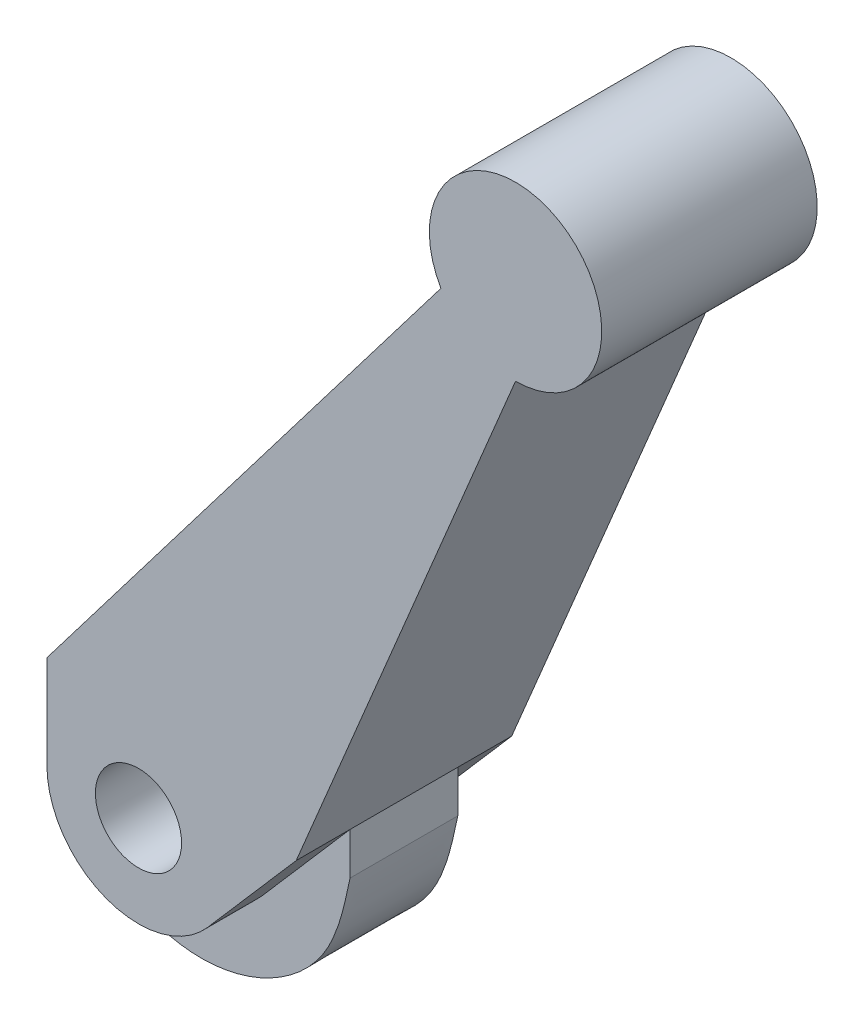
ISO-10303-21;
HEADER;
FILE_DESCRIPTION(('STEP AP214'),'2;1');
FILE_NAME('part.step','',(''),(''),'','','');
FILE_SCHEMA(('AUTOMOTIVE_DESIGN { 1 0 10303 214 1 1 1 1 }'));
ENDSEC;
DATA;
#1=APPLICATION_CONTEXT('core data for automotive mechanical design processes');
#2=APPLICATION_PROTOCOL_DEFINITION('international standard','automotive_design',2000,#1);
#3=PRODUCT_CONTEXT('',#1,'mechanical');
#4=PRODUCT('Part','Part','',(#3));
#5=PRODUCT_RELATED_PRODUCT_CATEGORY('part','',(#4));
#6=PRODUCT_DEFINITION_FORMATION('','',#4);
#7=PRODUCT_DEFINITION_CONTEXT('part definition',#1,'design');
#8=PRODUCT_DEFINITION('design','',#6,#7);
#9=PRODUCT_DEFINITION_SHAPE('','',#8);
#10=(LENGTH_UNIT() NAMED_UNIT(*) SI_UNIT(.MILLI.,.METRE.));
#11=(NAMED_UNIT(*) PLANE_ANGLE_UNIT() SI_UNIT($,.RADIAN.));
#12=(NAMED_UNIT(*) SI_UNIT($,.STERADIAN.) SOLID_ANGLE_UNIT());
#13=UNCERTAINTY_MEASURE_WITH_UNIT(LENGTH_MEASURE(1.E-05),#10,'distance_accuracy_value','');
#14=(GEOMETRIC_REPRESENTATION_CONTEXT(3) GLOBAL_UNCERTAINTY_ASSIGNED_CONTEXT((#13)) GLOBAL_UNIT_ASSIGNED_CONTEXT((#10,
#11,#12)) REPRESENTATION_CONTEXT('',''));
#15=CARTESIAN_POINT('',(0.,0.,0.));
#16=DIRECTION('',(0.,0.,1.));
#17=DIRECTION('',(1.,0.,0.));
#18=AXIS2_PLACEMENT_3D('',#15,#16,#17);
#19=CARTESIAN_POINT('',(0.513884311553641,-6.67200795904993,-2.5));
#20=DIRECTION('',(0.,0.,-1.));
#21=DIRECTION('',(-1.,0.,0.));
#22=AXIS2_PLACEMENT_3D('',#19,#20,#21);
#23=PLANE('',#22);
#24=DIRECTION('',(-0.606222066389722,-0.795295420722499,0.));
#25=VECTOR('',#24,1.);
#26=CARTESIAN_POINT('',(-4.77177252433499,3.63733239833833,-2.5));
#27=LINE('',#26,#25);
#28=CARTESIAN_POINT('',(-4.25,4.32183948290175,-2.5));
#29=VERTEX_POINT('',#28);
#30=CARTESIAN_POINT('',(-4.77177252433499,3.63733239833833,-2.5));
#31=VERTEX_POINT('',#30);
#32=EDGE_CURVE('E194',#29,#31,#27,.T.);
#33=ORIENTED_EDGE('',*,*,#32,.F.);
#34=DIRECTION('',(0.,-1.,0.));
#35=VECTOR('',#34,1.);
#36=CARTESIAN_POINT('',(-4.25,4.32183948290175,-2.5));
#37=LINE('',#36,#35);
#38=CARTESIAN_POINT('',(-4.25,0.,-2.5));
#39=VERTEX_POINT('',#38);
#40=EDGE_CURVE('E134',#29,#39,#37,.T.);
#41=ORIENTED_EDGE('',*,*,#40,.T.);
#42=CARTESIAN_POINT('',(0.,0.,-2.5));
#43=DIRECTION('',(0.,0.,1.));
#44=DIRECTION('',(1.,0.,0.));
#45=AXIS2_PLACEMENT_3D('',#42,#43,#44);
#46=CIRCLE('',#45,4.25);
#47=CARTESIAN_POINT('',(3.21104015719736,-2.78419128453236,-2.5));
#48=VERTEX_POINT('',#47);
#49=EDGE_CURVE('E115',#39,#48,#46,.T.);
#50=ORIENTED_EDGE('',*,*,#49,.T.);
#51=DIRECTION('',(0.655103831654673,0.755538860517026,0.));
#52=VECTOR('',#51,1.);
#53=CARTESIAN_POINT('',(3.21104015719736,-2.78419128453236,-2.5));
#54=LINE('',#53,#52);
#55=CARTESIAN_POINT('',(7.32,1.95471984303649,-2.5));
#56=VERTEX_POINT('',#55);
#57=EDGE_CURVE('E126',#48,#56,#54,.T.);
#58=ORIENTED_EDGE('',*,*,#57,.T.);
#59=DIRECTION('',(0.,1.,0.));
#60=VECTOR('',#59,1.);
#61=CARTESIAN_POINT('',(7.32,0.,-2.5));
#62=LINE('',#61,#60);
#63=CARTESIAN_POINT('',(7.32,0.,-2.5));
#64=VERTEX_POINT('',#63);
#65=EDGE_CURVE('E189',#64,#56,#62,.T.);
#66=ORIENTED_EDGE('',*,*,#65,.F.);
#67=CARTESIAN_POINT('',(-6.,0.,-2.5));
#68=CARTESIAN_POINT('',(-5.90543584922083,-1.07687700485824,-2.5));
#69=CARTESIAN_POINT('',(-5.71291765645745,-3.26923439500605,-2.5));
#70=CARTESIAN_POINT('',(-3.33365590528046,-5.85250984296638,-2.5));
#71=CARTESIAN_POINT('',(0.0190576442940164,-6.9748234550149,-2.5));
#72=CARTESIAN_POINT('',(3.59953729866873,-6.22879858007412,-2.5));
#73=CARTESIAN_POINT('',(6.53497983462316,-3.70497981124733,-2.5));
#74=CARTESIAN_POINT('',(7.05564668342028,-1.24764145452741,-2.5));
#75=CARTESIAN_POINT('',(7.32,0.,-2.5));
#76=B_SPLINE_CURVE_WITH_KNOTS('',3,(#67,#68,#69,#70,#71,#72,#73,#74,#75),.UNSPECIFIED.,.F.,.F.,
(4,1,1,1,1,1,4),(0.,0.152956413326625,0.311395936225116,0.475319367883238,0.644727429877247,
0.819620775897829,1.),.UNSPECIFIED.);
#77=CARTESIAN_POINT('',(-6.,0.,-2.5));
#78=VERTEX_POINT('',#77);
#79=EDGE_CURVE('E184',#78,#64,#76,.T.);
#80=ORIENTED_EDGE('',*,*,#79,.F.);
#81=CARTESIAN_POINT('',(0.,0.,-2.5));
#82=DIRECTION('',(0.,0.,1.));
#83=DIRECTION('',(1.,0.,0.));
#84=AXIS2_PLACEMENT_3D('',#81,#82,#83);
#85=CIRCLE('',#84,6.);
#86=EDGE_CURVE('E197',#31,#78,#85,.T.);
#87=ORIENTED_EDGE('',*,*,#86,.F.);
#88=EDGE_LOOP('',(#33,#41,#50,#58,#66,#80,#87));
#89=FACE_BOUND('',#88,.T.);
#90=ADVANCED_FACE('F14',(#89),#23,.T.);
#91=CARTESIAN_POINT('',(0.513884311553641,-6.67200795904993,2.5));
#92=DIRECTION('',(0.,0.,-1.));
#93=DIRECTION('',(-1.,0.,0.));
#94=AXIS2_PLACEMENT_3D('',#91,#92,#93);
#95=PLANE('',#94);
#96=DIRECTION('',(0.655103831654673,0.755538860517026,0.));
#97=VECTOR('',#96,1.);
#98=CARTESIAN_POINT('',(3.21104015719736,-2.78419128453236,2.5));
#99=LINE('',#98,#97);
#100=CARTESIAN_POINT('',(3.21104015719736,-2.78419128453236,2.5));
#101=VERTEX_POINT('',#100);
#102=CARTESIAN_POINT('',(7.32,1.95471984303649,2.5));
#103=VERTEX_POINT('',#102);
#104=EDGE_CURVE('E32',#101,#103,#99,.T.);
#105=ORIENTED_EDGE('',*,*,#104,.F.);
#106=CARTESIAN_POINT('',(0.,0.,2.5));
#107=DIRECTION('',(0.,0.,1.));
#108=DIRECTION('',(1.,0.,0.));
#109=AXIS2_PLACEMENT_3D('',#106,#107,#108);
#110=CIRCLE('',#109,4.25);
#111=CARTESIAN_POINT('',(-4.25,0.,2.5));
#112=VERTEX_POINT('',#111);
#113=EDGE_CURVE('E157',#112,#101,#110,.T.);
#114=ORIENTED_EDGE('',*,*,#113,.F.);
#115=DIRECTION('',(0.,-1.,0.));
#116=VECTOR('',#115,1.);
#117=CARTESIAN_POINT('',(-4.25,4.32183948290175,2.5));
#118=LINE('',#117,#116);
#119=CARTESIAN_POINT('',(-4.25,4.32183948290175,2.5));
#120=VERTEX_POINT('',#119);
#121=EDGE_CURVE('E38',#120,#112,#118,.T.);
#122=ORIENTED_EDGE('',*,*,#121,.F.);
#123=DIRECTION('',(-0.606222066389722,-0.795295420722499,0.));
#124=VECTOR('',#123,1.);
#125=CARTESIAN_POINT('',(-4.77177252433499,3.63733239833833,2.5));
#126=LINE('',#125,#124);
#127=CARTESIAN_POINT('',(-4.77177252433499,3.63733239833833,2.5));
#128=VERTEX_POINT('',#127);
#129=EDGE_CURVE('E224',#120,#128,#126,.T.);
#130=ORIENTED_EDGE('',*,*,#129,.T.);
#131=CARTESIAN_POINT('',(0.,0.,2.5));
#132=DIRECTION('',(0.,0.,1.));
#133=DIRECTION('',(1.,0.,0.));
#134=AXIS2_PLACEMENT_3D('',#131,#132,#133);
#135=CIRCLE('',#134,6.);
#136=CARTESIAN_POINT('',(-6.,0.,2.5));
#137=VERTEX_POINT('',#136);
#138=EDGE_CURVE('E235',#128,#137,#135,.T.);
#139=ORIENTED_EDGE('',*,*,#138,.T.);
#140=CARTESIAN_POINT('',(-6.,0.,2.5));
#141=CARTESIAN_POINT('',(-5.90543584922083,-1.07687700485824,2.5));
#142=CARTESIAN_POINT('',(-5.71291765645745,-3.26923439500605,2.5));
#143=CARTESIAN_POINT('',(-3.33365590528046,-5.85250984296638,2.5));
#144=CARTESIAN_POINT('',(0.0190576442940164,-6.9748234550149,2.5));
#145=CARTESIAN_POINT('',(3.59953729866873,-6.22879858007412,2.5));
#146=CARTESIAN_POINT('',(6.53497983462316,-3.70497981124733,2.5));
#147=CARTESIAN_POINT('',(7.05564668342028,-1.24764145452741,2.5));
#148=CARTESIAN_POINT('',(7.32,0.,2.5));
#149=B_SPLINE_CURVE_WITH_KNOTS('',3,(#140,#141,#142,#143,#144,#145,#146,#147,#148),
.UNSPECIFIED.,.F.,.F.,(4,1,1,1,1,1,4),(0.,0.152956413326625,0.311395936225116,0.475319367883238,
0.644727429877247,0.819620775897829,1.),.UNSPECIFIED.);
#150=CARTESIAN_POINT('',(7.32,0.,2.5));
#151=VERTEX_POINT('',#150);
#152=EDGE_CURVE('E219',#137,#151,#149,.T.);
#153=ORIENTED_EDGE('',*,*,#152,.T.);
#154=DIRECTION('',(0.,1.,0.));
#155=VECTOR('',#154,1.);
#156=CARTESIAN_POINT('',(7.32,0.,2.5));
#157=LINE('',#156,#155);
#158=EDGE_CURVE('E221',#151,#103,#157,.T.);
#159=ORIENTED_EDGE('',*,*,#158,.T.);
#160=EDGE_LOOP('',(#105,#114,#122,#130,#139,#153,#159));
#161=FACE_BOUND('',#160,.T.);
#162=ADVANCED_FACE('F251',(#161),#95,.F.);
#163=DIRECTION('',(0.,0.,-1.));
#164=VECTOR('',#163,1.);
#165=SURFACE_OF_LINEAR_EXTRUSION('',#149,#164);
#166=ORIENTED_EDGE('',*,*,#79,.T.);
#167=DIRECTION('',(0.,0.,-1.));
#168=VECTOR('',#167,1.);
#169=CARTESIAN_POINT('',(7.32,0.,2.5));
#170=LINE('',#169,#168);
#171=EDGE_CURVE('E9',#151,#64,#170,.T.);
#172=ORIENTED_EDGE('',*,*,#171,.F.);
#173=ORIENTED_EDGE('',*,*,#152,.F.);
#174=DIRECTION('',(0.,0.,-1.));
#175=VECTOR('',#174,1.);
#176=CARTESIAN_POINT('',(-6.,0.,2.5));
#177=LINE('',#176,#175);
#178=EDGE_CURVE('E252',#137,#78,#177,.T.);
#179=ORIENTED_EDGE('',*,*,#178,.T.);
#180=EDGE_LOOP('',(#166,#172,#173,#179));
#181=FACE_BOUND('',#180,.T.);
#182=ADVANCED_FACE('F16',(#181),#165,.F.);
#183=CARTESIAN_POINT('',(7.32,0.,2.5));
#184=DIRECTION('',(-1.,0.,0.));
#185=DIRECTION('',(0.,0.,1.));
#186=AXIS2_PLACEMENT_3D('',#183,#184,#185);
#187=PLANE('',#186);
#188=ORIENTED_EDGE('',*,*,#65,.T.);
#189=DIRECTION('',(0.,0.,-1.));
#190=VECTOR('',#189,1.);
#191=CARTESIAN_POINT('',(7.32,1.95471984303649,2.5));
#192=LINE('',#191,#190);
#193=EDGE_CURVE('E24',#103,#56,#192,.T.);
#194=ORIENTED_EDGE('',*,*,#193,.F.);
#195=ORIENTED_EDGE('',*,*,#158,.F.);
#196=ORIENTED_EDGE('',*,*,#171,.T.);
#197=EDGE_LOOP('',(#188,#194,#195,#196));
#198=FACE_BOUND('',#197,.T.);
#199=ADVANCED_FACE('F256',(#198),#187,.F.);
#200=CARTESIAN_POINT('',(7.32,1.95471984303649,2.5));
#201=DIRECTION('',(-0.922651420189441,0.385635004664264,0.));
#202=DIRECTION('',(-0.385635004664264,-0.922651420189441,0.));
#203=AXIS2_PLACEMENT_3D('',#200,#201,#202);
#204=PLANE('',#203);
#205=ORIENTED_EDGE('',*,*,#193,.T.);
#206=DIRECTION('',(0.,0.,1.));
#207=VECTOR('',#206,1.);
#208=CARTESIAN_POINT('',(7.32,1.95471984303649,-5.));
#209=LINE('',#208,#207);
#210=CARTESIAN_POINT('',(7.32,1.95471984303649,-5.));
#211=VERTEX_POINT('',#210);
#212=EDGE_CURVE('E122',#211,#56,#209,.T.);
#213=ORIENTED_EDGE('',*,*,#212,.F.);
#214=DIRECTION('',(0.385635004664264,0.922651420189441,0.));
#215=VECTOR('',#214,1.);
#216=CARTESIAN_POINT('',(7.32,1.95471984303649,-5.));
#217=LINE('',#216,#215);
#218=CARTESIAN_POINT('',(17.5,26.3108891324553,-5.));
#219=VERTEX_POINT('',#218);
#220=EDGE_CURVE('E142',#211,#219,#217,.T.);
#221=ORIENTED_EDGE('',*,*,#220,.T.);
#222=DIRECTION('',(0.,0.,-1.));
#223=VECTOR('',#222,1.);
#224=CARTESIAN_POINT('',(17.5,26.3108891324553,2.5));
#225=LINE('',#224,#223);
#226=CARTESIAN_POINT('',(17.5,26.3108891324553,5.));
#227=VERTEX_POINT('',#226);
#228=EDGE_CURVE('E260',#227,#219,#225,.T.);
#229=ORIENTED_EDGE('',*,*,#228,.F.);
#230=DIRECTION('',(0.385635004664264,0.922651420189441,0.));
#231=VECTOR('',#230,1.);
#232=CARTESIAN_POINT('',(7.32,1.95471984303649,5.));
#233=LINE('',#232,#231);
#234=CARTESIAN_POINT('',(7.32,1.95471984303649,5.));
#235=VERTEX_POINT('',#234);
#236=EDGE_CURVE('E171',#235,#227,#233,.T.);
#237=ORIENTED_EDGE('',*,*,#236,.F.);
#238=DIRECTION('',(0.,0.,-1.));
#239=VECTOR('',#238,1.);
#240=CARTESIAN_POINT('',(7.32,1.95471984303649,5.));
#241=LINE('',#240,#239);
#242=EDGE_CURVE('E174',#235,#103,#241,.T.);
#243=ORIENTED_EDGE('',*,*,#242,.T.);
#244=EDGE_LOOP('',(#205,#213,#221,#229,#237,#243));
#245=FACE_BOUND('',#244,.T.);
#246=ADVANCED_FACE('F267',(#245),#204,.F.);
#247=CARTESIAN_POINT('',(17.5,30.3108891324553,2.5));
#248=DIRECTION('',(0.,0.,-1.));
#249=DIRECTION('',(-1.,0.,0.));
#250=AXIS2_PLACEMENT_3D('',#247,#248,#249);
#251=CYLINDRICAL_SURFACE('',#250,4.);
#252=ORIENTED_EDGE('',*,*,#228,.T.);
#253=CARTESIAN_POINT('',(17.5,30.3108891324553,-5.));
#254=DIRECTION('',(0.,0.,1.));
#255=DIRECTION('',(1.,0.,0.));
#256=AXIS2_PLACEMENT_3D('',#253,#254,#255);
#257=CIRCLE('',#256,4.);
#258=CARTESIAN_POINT('',(14.0358983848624,28.3108891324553,-5.));
#259=VERTEX_POINT('',#258);
#260=EDGE_CURVE('E136',#219,#259,#257,.T.);
#261=ORIENTED_EDGE('',*,*,#260,.T.);
#262=DIRECTION('',(0.,0.,-1.));
#263=VECTOR('',#262,1.);
#264=CARTESIAN_POINT('',(14.0358983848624,28.3108891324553,2.5));
#265=LINE('',#264,#263);
#266=CARTESIAN_POINT('',(14.0358983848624,28.3108891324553,5.));
#267=VERTEX_POINT('',#266);
#268=EDGE_CURVE('E274',#267,#259,#265,.T.);
#269=ORIENTED_EDGE('',*,*,#268,.F.);
#270=CARTESIAN_POINT('',(17.5,30.3108891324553,5.));
#271=DIRECTION('',(0.,0.,1.));
#272=DIRECTION('',(1.,0.,0.));
#273=AXIS2_PLACEMENT_3D('',#270,#271,#272);
#274=CIRCLE('',#273,4.);
#275=EDGE_CURVE('E160',#227,#267,#274,.T.);
#276=ORIENTED_EDGE('',*,*,#275,.F.);
#277=EDGE_LOOP('',(#252,#261,#269,#276));
#278=FACE_BOUND('',#277,.T.);
#279=ADVANCED_FACE('F272',(#278),#251,.T.);
#280=CARTESIAN_POINT('',(-4.77177252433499,3.63733239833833,2.5));
#281=DIRECTION('',(0.795295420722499,-0.606222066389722,0.));
#282=DIRECTION('',(0.606222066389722,0.795295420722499,0.));
#283=AXIS2_PLACEMENT_3D('',#280,#281,#282);
#284=PLANE('',#283);
#285=ORIENTED_EDGE('',*,*,#268,.T.);
#286=DIRECTION('',(-0.606222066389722,-0.795295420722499,0.));
#287=VECTOR('',#286,1.);
#288=CARTESIAN_POINT('',(14.0358983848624,28.3108891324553,-5.));
#289=LINE('',#288,#287);
#290=CARTESIAN_POINT('',(-4.25,4.32183948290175,-5.));
#291=VERTEX_POINT('',#290);
#292=EDGE_CURVE('E151',#259,#291,#289,.T.);
#293=ORIENTED_EDGE('',*,*,#292,.T.);
#294=DIRECTION('',(0.,0.,1.));
#295=VECTOR('',#294,1.);
#296=CARTESIAN_POINT('',(-4.25,4.32183948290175,-5.));
#297=LINE('',#296,#295);
#298=EDGE_CURVE('E154',#291,#29,#297,.T.);
#299=ORIENTED_EDGE('',*,*,#298,.T.);
#300=ORIENTED_EDGE('',*,*,#32,.T.);
#301=DIRECTION('',(0.,0.,-1.));
#302=VECTOR('',#301,1.);
#303=CARTESIAN_POINT('',(-4.77177252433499,3.63733239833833,2.5));
#304=LINE('',#303,#302);
#305=EDGE_CURVE('E249',#128,#31,#304,.T.);
#306=ORIENTED_EDGE('',*,*,#305,.F.);
#307=ORIENTED_EDGE('',*,*,#129,.F.);
#308=DIRECTION('',(0.,0.,-1.));
#309=VECTOR('',#308,1.);
#310=CARTESIAN_POINT('',(-4.25,4.32183948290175,5.));
#311=LINE('',#310,#309);
#312=CARTESIAN_POINT('',(-4.25,4.32183948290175,5.));
#313=VERTEX_POINT('',#312);
#314=EDGE_CURVE('E183',#313,#120,#311,.T.);
#315=ORIENTED_EDGE('',*,*,#314,.F.);
#316=DIRECTION('',(-0.606222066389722,-0.795295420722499,0.));
#317=VECTOR('',#316,1.);
#318=CARTESIAN_POINT('',(14.0358983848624,28.3108891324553,5.));
#319=LINE('',#318,#317);
#320=EDGE_CURVE('E163',#267,#313,#319,.T.);
#321=ORIENTED_EDGE('',*,*,#320,.F.);
#322=EDGE_LOOP('',(#285,#293,#299,#300,#306,#307,#315,#321));
#323=FACE_BOUND('',#322,.T.);
#324=ADVANCED_FACE('F207',(#323),#284,.F.);
#325=CARTESIAN_POINT('',(0.,0.,2.5));
#326=DIRECTION('',(0.,0.,-1.));
#327=DIRECTION('',(-1.,0.,0.));
#328=AXIS2_PLACEMENT_3D('',#325,#326,#327);
#329=CYLINDRICAL_SURFACE('',#328,6.);
#330=ORIENTED_EDGE('',*,*,#86,.T.);
#331=ORIENTED_EDGE('',*,*,#178,.F.);
#332=ORIENTED_EDGE('',*,*,#138,.F.);
#333=ORIENTED_EDGE('',*,*,#305,.T.);
#334=EDGE_LOOP('',(#330,#331,#332,#333));
#335=FACE_BOUND('',#334,.T.);
#336=ADVANCED_FACE('F253',(#335),#329,.T.);
#337=CARTESIAN_POINT('',(-4.25,4.32183948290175,5.));
#338=DIRECTION('',(1.,0.,0.));
#339=DIRECTION('',(0.,1.,0.));
#340=AXIS2_PLACEMENT_3D('',#337,#338,#339);
#341=PLANE('',#340);
#342=ORIENTED_EDGE('',*,*,#121,.T.);
#343=DIRECTION('',(0.,0.,-1.));
#344=VECTOR('',#343,1.);
#345=CARTESIAN_POINT('',(-4.25,0.,5.));
#346=LINE('',#345,#344);
#347=CARTESIAN_POINT('',(-4.25,0.,5.));
#348=VERTEX_POINT('',#347);
#349=EDGE_CURVE('E180',#348,#112,#346,.T.);
#350=ORIENTED_EDGE('',*,*,#349,.F.);
#351=DIRECTION('',(0.,-1.,0.));
#352=VECTOR('',#351,1.);
#353=CARTESIAN_POINT('',(-4.25,4.32183948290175,5.));
#354=LINE('',#353,#352);
#355=EDGE_CURVE('E165',#313,#348,#354,.T.);
#356=ORIENTED_EDGE('',*,*,#355,.F.);
#357=ORIENTED_EDGE('',*,*,#314,.T.);
#358=EDGE_LOOP('',(#342,#350,#356,#357));
#359=FACE_BOUND('',#358,.T.);
#360=ADVANCED_FACE('F246',(#359),#341,.F.);
#361=CARTESIAN_POINT('',(0.,0.,5.));
#362=DIRECTION('',(0.,0.,-1.));
#363=DIRECTION('',(-1.,0.,0.));
#364=AXIS2_PLACEMENT_3D('',#361,#362,#363);
#365=CYLINDRICAL_SURFACE('',#364,4.25);
#366=ORIENTED_EDGE('',*,*,#113,.T.);
#367=DIRECTION('',(0.,0.,-1.));
#368=VECTOR('',#367,1.);
#369=CARTESIAN_POINT('',(3.21104015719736,-2.78419128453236,5.));
#370=LINE('',#369,#368);
#371=CARTESIAN_POINT('',(3.21104015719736,-2.78419128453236,5.));
#372=VERTEX_POINT('',#371);
#373=EDGE_CURVE('E177',#372,#101,#370,.T.);
#374=ORIENTED_EDGE('',*,*,#373,.F.);
#375=CARTESIAN_POINT('',(0.,0.,5.));
#376=DIRECTION('',(0.,0.,1.));
#377=DIRECTION('',(1.,0.,0.));
#378=AXIS2_PLACEMENT_3D('',#375,#376,#377);
#379=CIRCLE('',#378,4.25);
#380=EDGE_CURVE('E167',#348,#372,#379,.T.);
#381=ORIENTED_EDGE('',*,*,#380,.F.);
#382=ORIENTED_EDGE('',*,*,#349,.T.);
#383=EDGE_LOOP('',(#366,#374,#381,#382));
#384=FACE_BOUND('',#383,.T.);
#385=ADVANCED_FACE('F372',(#384),#365,.T.);
#386=CARTESIAN_POINT('',(3.21104015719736,-2.78419128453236,5.));
#387=DIRECTION('',(-0.755538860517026,0.655103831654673,0.));
#388=DIRECTION('',(-0.655103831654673,-0.755538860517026,0.));
#389=AXIS2_PLACEMENT_3D('',#386,#387,#388);
#390=PLANE('',#389);
#391=ORIENTED_EDGE('',*,*,#104,.T.);
#392=ORIENTED_EDGE('',*,*,#242,.F.);
#393=DIRECTION('',(0.655103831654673,0.755538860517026,0.));
#394=VECTOR('',#393,1.);
#395=CARTESIAN_POINT('',(3.21104015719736,-2.78419128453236,5.));
#396=LINE('',#395,#394);
#397=EDGE_CURVE('E169',#372,#235,#396,.T.);
#398=ORIENTED_EDGE('',*,*,#397,.F.);
#399=ORIENTED_EDGE('',*,*,#373,.T.);
#400=EDGE_LOOP('',(#391,#392,#398,#399));
#401=FACE_BOUND('',#400,.T.);
#402=ADVANCED_FACE('F263',(#401),#390,.F.);
#403=CARTESIAN_POINT('',(17.5,30.3108891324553,5.));
#404=DIRECTION('',(0.,0.,1.));
#405=DIRECTION('',(1.,0.,0.));
#406=AXIS2_PLACEMENT_3D('',#403,#404,#405);
#407=PLANE('',#406);
#408=CARTESIAN_POINT('',(0.,0.,5.));
#409=DIRECTION('',(0.,0.,1.));
#410=DIRECTION('',(1.,0.,0.));
#411=AXIS2_PLACEMENT_3D('',#408,#409,#410);
#412=CIRCLE('',#411,2.);
#413=CARTESIAN_POINT('',(2.,0.,5.));
#414=VERTEX_POINT('',#413);
#415=EDGE_CURVE('E130',#414,#414,#412,.T.);
#416=ORIENTED_EDGE('',*,*,#415,.F.);
#417=EDGE_LOOP('',(#416));
#418=FACE_BOUND('',#417,.T.);
#419=ORIENTED_EDGE('',*,*,#275,.T.);
#420=ORIENTED_EDGE('',*,*,#320,.T.);
#421=ORIENTED_EDGE('',*,*,#355,.T.);
#422=ORIENTED_EDGE('',*,*,#380,.T.);
#423=ORIENTED_EDGE('',*,*,#397,.T.);
#424=ORIENTED_EDGE('',*,*,#236,.T.);
#425=EDGE_LOOP('',(#419,#420,#421,#422,#423,#424));
#426=FACE_BOUND('',#425,.T.);
#427=ADVANCED_FACE('F270',(#418,#426),#407,.T.);
#428=CARTESIAN_POINT('',(3.21104015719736,-2.78419128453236,-5.));
#429=DIRECTION('',(0.755538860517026,-0.655103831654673,0.));
#430=DIRECTION('',(0.655103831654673,0.755538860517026,0.));
#431=AXIS2_PLACEMENT_3D('',#428,#429,#430);
#432=PLANE('',#431);
#433=ORIENTED_EDGE('',*,*,#57,.F.);
#434=DIRECTION('',(0.,0.,1.));
#435=VECTOR('',#434,1.);
#436=CARTESIAN_POINT('',(3.21104015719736,-2.78419128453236,-5.));
#437=LINE('',#436,#435);
#438=CARTESIAN_POINT('',(3.21104015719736,-2.78419128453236,-5.));
#439=VERTEX_POINT('',#438);
#440=EDGE_CURVE('E111',#439,#48,#437,.T.);
#441=ORIENTED_EDGE('',*,*,#440,.F.);
#442=DIRECTION('',(0.655103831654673,0.755538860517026,0.));
#443=VECTOR('',#442,1.);
#444=CARTESIAN_POINT('',(3.21104015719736,-2.78419128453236,-5.));
#445=LINE('',#444,#443);
#446=EDGE_CURVE('E145',#439,#211,#445,.T.);
#447=ORIENTED_EDGE('',*,*,#446,.T.);
#448=ORIENTED_EDGE('',*,*,#212,.T.);
#449=EDGE_LOOP('',(#433,#441,#447,#448));
#450=FACE_BOUND('',#449,.T.);
#451=ADVANCED_FACE('F127',(#450),#432,.T.);
#452=CARTESIAN_POINT('',(0.,0.,-5.));
#453=DIRECTION('',(0.,0.,1.));
#454=DIRECTION('',(1.,0.,0.));
#455=AXIS2_PLACEMENT_3D('',#452,#453,#454);
#456=CYLINDRICAL_SURFACE('',#455,4.25);
#457=ORIENTED_EDGE('',*,*,#49,.F.);
#458=DIRECTION('',(0.,0.,1.));
#459=VECTOR('',#458,1.);
#460=CARTESIAN_POINT('',(-4.25,0.,-5.));
#461=LINE('',#460,#459);
#462=CARTESIAN_POINT('',(-4.25,0.,-5.));
#463=VERTEX_POINT('',#462);
#464=EDGE_CURVE('E123',#463,#39,#461,.T.);
#465=ORIENTED_EDGE('',*,*,#464,.F.);
#466=CARTESIAN_POINT('',(0.,0.,-5.));
#467=DIRECTION('',(0.,0.,1.));
#468=DIRECTION('',(1.,0.,0.));
#469=AXIS2_PLACEMENT_3D('',#466,#467,#468);
#470=CIRCLE('',#469,4.25);
#471=EDGE_CURVE('E118',#463,#439,#470,.T.);
#472=ORIENTED_EDGE('',*,*,#471,.T.);
#473=ORIENTED_EDGE('',*,*,#440,.T.);
#474=EDGE_LOOP('',(#457,#465,#472,#473));
#475=FACE_BOUND('',#474,.T.);
#476=ADVANCED_FACE('F113',(#475),#456,.T.);
#477=CARTESIAN_POINT('',(-4.25,4.32183948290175,-5.));
#478=DIRECTION('',(-1.,0.,0.));
#479=DIRECTION('',(0.,-1.,0.));
#480=AXIS2_PLACEMENT_3D('',#477,#478,#479);
#481=PLANE('',#480);
#482=ORIENTED_EDGE('',*,*,#40,.F.);
#483=ORIENTED_EDGE('',*,*,#298,.F.);
#484=DIRECTION('',(0.,-1.,0.));
#485=VECTOR('',#484,1.);
#486=CARTESIAN_POINT('',(-4.25,4.32183948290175,-5.));
#487=LINE('',#486,#485);
#488=EDGE_CURVE('E148',#291,#463,#487,.T.);
#489=ORIENTED_EDGE('',*,*,#488,.T.);
#490=ORIENTED_EDGE('',*,*,#464,.T.);
#491=EDGE_LOOP('',(#482,#483,#489,#490));
#492=FACE_BOUND('',#491,.T.);
#493=ADVANCED_FACE('F213',(#492),#481,.T.);
#494=CARTESIAN_POINT('',(17.5,30.3108891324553,-5.));
#495=DIRECTION('',(0.,0.,-1.));
#496=DIRECTION('',(1.,0.,0.));
#497=AXIS2_PLACEMENT_3D('',#494,#495,#496);
#498=PLANE('',#497);
#499=CARTESIAN_POINT('',(0.,0.,-5.));
#500=DIRECTION('',(0.,0.,-1.));
#501=DIRECTION('',(-1.,0.,0.));
#502=AXIS2_PLACEMENT_3D('',#499,#500,#501);
#503=CIRCLE('',#502,2.);
#504=CARTESIAN_POINT('',(-2.,0.,-5.));
#505=VERTEX_POINT('',#504);
#506=EDGE_CURVE('E19',#505,#505,#503,.T.);
#507=ORIENTED_EDGE('',*,*,#506,.F.);
#508=EDGE_LOOP('',(#507));
#509=FACE_BOUND('',#508,.T.);
#510=ORIENTED_EDGE('',*,*,#260,.F.);
#511=ORIENTED_EDGE('',*,*,#220,.F.);
#512=ORIENTED_EDGE('',*,*,#446,.F.);
#513=ORIENTED_EDGE('',*,*,#471,.F.);
#514=ORIENTED_EDGE('',*,*,#488,.F.);
#515=ORIENTED_EDGE('',*,*,#292,.F.);
#516=EDGE_LOOP('',(#510,#511,#512,#513,#514,#515));
#517=FACE_BOUND('',#516,.T.);
#518=ADVANCED_FACE('F280',(#509,#517),#498,.T.);
#519=CARTESIAN_POINT('',(0.,0.,-8.75));
#520=DIRECTION('',(0.,0.,1.));
#521=DIRECTION('',(1.,0.,0.));
#522=AXIS2_PLACEMENT_3D('',#519,#520,#521);
#523=CYLINDRICAL_SURFACE('',#522,2.);
#524=ORIENTED_EDGE('',*,*,#415,.T.);
#525=EDGE_LOOP('',(#524));
#526=FACE_BOUND('',#525,.T.);
#527=ORIENTED_EDGE('',*,*,#506,.T.);
#528=EDGE_LOOP('',(#527));
#529=FACE_BOUND('',#528,.T.);
#530=ADVANCED_FACE('F282',(#526,#529),#523,.F.);
#531=CLOSED_SHELL('',(#90,#162,#182,#199,#246,#279,#324,#336,#360,#385,#402,#427,#451,#476,#493,
#518,#530));
#532=MANIFOLD_SOLID_BREP('B1',#531);
#533=ADVANCED_BREP_SHAPE_REPRESENTATION('',(#18,#532),#14);
#534=SHAPE_DEFINITION_REPRESENTATION(#9,#533);
ENDSEC;
END-ISO-10303-21;
